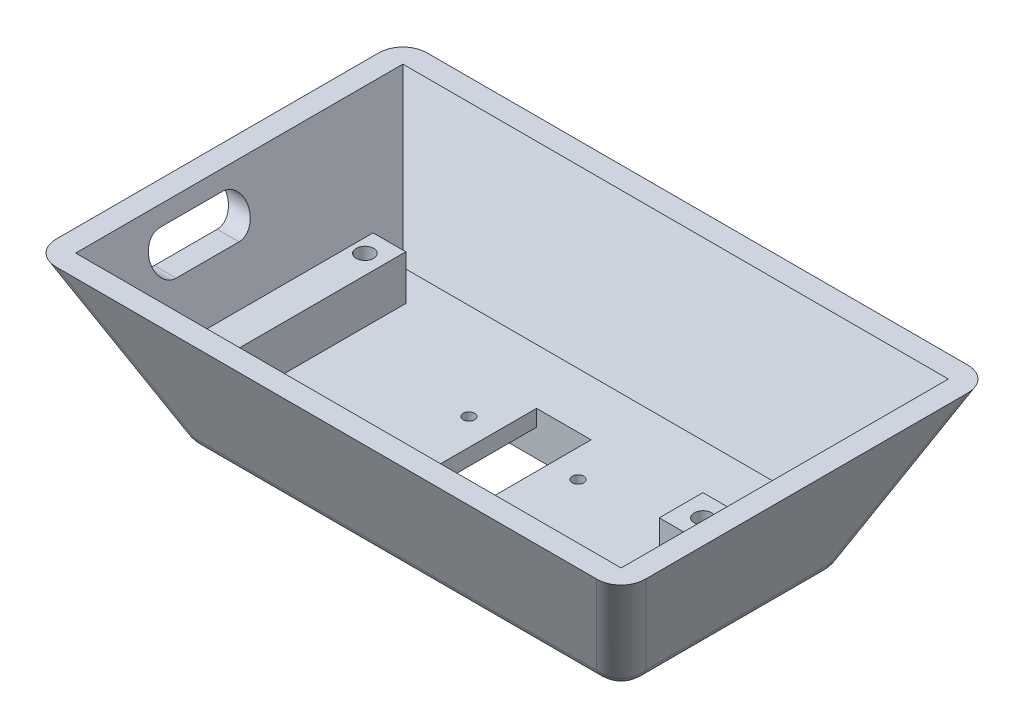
from build123d import *

# Parameters (mm, degrees)
SKETCH1_W                    = 80
SKETCH1_H                    = 40
BASE_EXTRUSION_DEPTH         = 30
BASE_EXTRUSION_DRAFT         = -25
SKETCH2_W                    = 30.2
SKETCH2_H                    = 19.2
TRIANGLE_ATTACH_CUTOUT_DEPTH = 5
SKETCH3_W                    = 99.97845949
SKETCH3_H                    = 59.97845949
SHELL_OUT_THE_BASE_DEPTH     = 22
SHELL_OUT_THE_BASE_DRAFT     = -25
LED_STRIP_CUTOUT_REACH       = 70.521
SKETCH5_R                    = 1.05
SKETCH5_W                    = 10
SKETCH5_H                    = 19.2
PCB_START                    = 8
SKETCH13_W                   = 6
SKETCH13_H                   = 34
SKETCH13_R                   = 1.6002
SKETCH13_W_2                 = 8
SKETCH13_H_2                 = 8
PCB_LEDGE_DEPTH              = 8.2
USB_C_CUTOUT_REACH           = 72.499
FILLET1_R                    = 5


with BuildPart() as part:
    # Sketch1 → Base Extrusion (with draft: the straight prism first)
    with BuildSketch(Plane(origin=(0, 0, 0), x_dir=(1, 0, 0), z_dir=(0, 1, 0))):
        Rectangle(SKETCH1_W, SKETCH1_H)
    extrude(amount=BASE_EXTRUSION_DEPTH)
    # Base Extrusion: the draft: its side faces are tilted about the plane it starts from
    base_extrusion_sides = [part.faces().sort_by_distance(p)[0] for p in [
        (-40, 15, 0),
        (0, 15, 20),
        (40, 15, 0),
        (0, 15, -20),
    ]]
    draft(base_extrusion_sides, Plane(origin=(0, 0, 0), x_dir=(1, 0, 0), z_dir=(0, 1, 0)), BASE_EXTRUSION_DRAFT)

    # Sketch2 → Triangle Attach Cutout (cut)
    with BuildSketch(Plane.XZ):
        Rectangle(SKETCH2_W, SKETCH2_H)
    extrude(amount=-TRIANGLE_ATTACH_CUTOUT_DEPTH, mode=Mode.SUBTRACT)


with BuildPart() as shell_out_the_base_tool:
    # Sketch3 → Shell out the base (with draft: the straight prism first)
    with BuildSketch(Plane(origin=(0, 30, 0), x_dir=(1, 0, 0), z_dir=(0, 1, 0))):
        Rectangle(SKETCH3_W, SKETCH3_H)
    extrude(amount=-SHELL_OUT_THE_BASE_DEPTH)
    # Shell out the base: the draft: its side faces are tilted about the plane it starts from
    shell_out_the_base_sides = [shell_out_the_base_tool.faces().sort_by_distance(p)[0] for p in [
        (-49.989229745, 19, 0),
        (0, 19, 29.989229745),
        (49.989229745, 19, 0),
        (0, 19, -29.989229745),
    ]]
    draft(shell_out_the_base_sides, Plane(origin=(0, 30, 0), x_dir=(1, 0, 0), z_dir=(0, 1, 0)), SHELL_OUT_THE_BASE_DRAFT)


with BuildPart() as part_1:
    add(part.part)

    # Shell out the base: cut by shell_out_the_base_tool
    add(shell_out_the_base_tool.part, mode=Mode.SUBTRACT)

    # Sketch5 → LED Strip Cutout (cut, up to next)
    with BuildSketch(Plane.XZ.offset(-5), mode=Mode.PRIVATE) as led_strip_cutout_sk1:
        with Locations(Location((-10, -2.1, 0), (0, 0, 270))):
            Circle(SKETCH5_R)
    led_strip_cutout_tool1 = extrude(led_strip_cutout_sk1.sketch, amount=-LED_STRIP_CUTOUT_REACH, mode=Mode.PRIVATE) & part_1.part
    # Sketch5 → LED Strip Cutout (cut, up to next)
    with BuildSketch(Plane.XZ.offset(-5), mode=Mode.PRIVATE) as led_strip_cutout_sk2:
        with Locations(Location((10, -2.1, 0), (0, 0, 90))):
            Circle(SKETCH5_R)
    led_strip_cutout_tool2 = extrude(led_strip_cutout_sk2.sketch, amount=-LED_STRIP_CUTOUT_REACH, mode=Mode.PRIVATE) & part_1.part
    # Sketch5 → LED Strip Cutout (cut, up to next)
    with BuildSketch(Plane.XZ.offset(-5), mode=Mode.PRIVATE) as led_strip_cutout_sk3:
        with Locations((-0.1, 0)):
            Rectangle(SKETCH5_W, SKETCH5_H)
    led_strip_cutout_tool3 = extrude(led_strip_cutout_sk3.sketch, amount=-LED_STRIP_CUTOUT_REACH, mode=Mode.PRIVATE) & part_1.part
    add(led_strip_cutout_tool1.solids().sort_by_distance((-10, 5, -2.1))[0], mode=Mode.SUBTRACT)
    add(led_strip_cutout_tool2.solids().sort_by_distance((10, 5, -2.1))[0], mode=Mode.SUBTRACT)
    add(led_strip_cutout_tool3.solids().sort_by_distance((-0.1, 5, 0))[0], mode=Mode.SUBTRACT)

    # Sketch13 → PCB Ledge (add)
    # profile 1 of 2: a face of its own
    with BuildSketch(Plane(origin=(0, 0, 0), x_dir=(1, 0, 0), z_dir=(0, 1, 0)).offset(PCB_START)):
        with Locations((-36.730461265, -2.730461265)):
            Rectangle(SKETCH13_W, SKETCH13_H)
        with Locations(Location((-37.230461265, 10.269538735, 0), (0, 0, 270))):
            Circle(SKETCH13_R, mode=Mode.SUBTRACT)
    # profile 2 of 2: a face of its own
    with BuildSketch(Plane(origin=(0, 0, 0), x_dir=(1, 0, 0), z_dir=(0, 1, 0)).offset(PCB_START)):
        with Locations((35.730461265, -0.730461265)):
            Rectangle(SKETCH13_W_2, SKETCH13_H_2)
        with Locations(Location((35.730461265, -0.730461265, 0), (0, 0, 270))):
            Circle(SKETCH13_R, mode=Mode.SUBTRACT)
    extrude(amount=PCB_LEDGE_DEPTH)

    # USB-C Cutout: up to this plane
    usb_c_cutout_end = Plane(origin=(-40, 0, -20), z_dir=(-0.9063077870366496, -0.4226182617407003, 0))
    # Sketch14 → USB-C Cutout (cut, up to the surface)
    with BuildSketch(Plane(origin=(0, 0, 0), x_dir=(0, 0, -1), z_dir=(1, 0, 0)), mode=Mode.PRIVATE) as usb_c_cutout_sk1:
        with BuildLine():
            Line((-15.75, 27.5), (-4.25, 27.5))
            ThreePointArc((-4.25, 27.5), (-1, 24.25), (-4.25, 21))
            Line((-4.25, 21), (-15.75, 21))
            ThreePointArc((-15.75, 21), (-19, 24.25), (-15.75, 27.5))
        make_face()
    usb_c_cutout_tool1 = split(extrude(usb_c_cutout_sk1.sketch, amount=-USB_C_CUTOUT_REACH, mode=Mode.PRIVATE), bisect_by=usb_c_cutout_end, keep=Keep.BOTH, mode=Mode.PRIVATE)
    add(usb_c_cutout_tool1.solids().sort_by_distance((0, 24.25, 10))[0], mode=Mode.SUBTRACT)

    # Fillet1
    fillet1_edges = [part_1.edges().sort_by_distance(p)[0] for p in [
        (0, 0, 20),
        (-40, 0, 0),
        (0, 0, -20),
        (40, 0, 0),
        (46.994614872, 15, 26.994614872),
        (-46.994614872, 15, 26.994614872),
        (-46.994614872, 15, -26.994614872),
        (46.994614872, 15, -26.994614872),
    ]]
    fillet(fillet1_edges, radius=FILLET1_R)


solid = part_1.part
